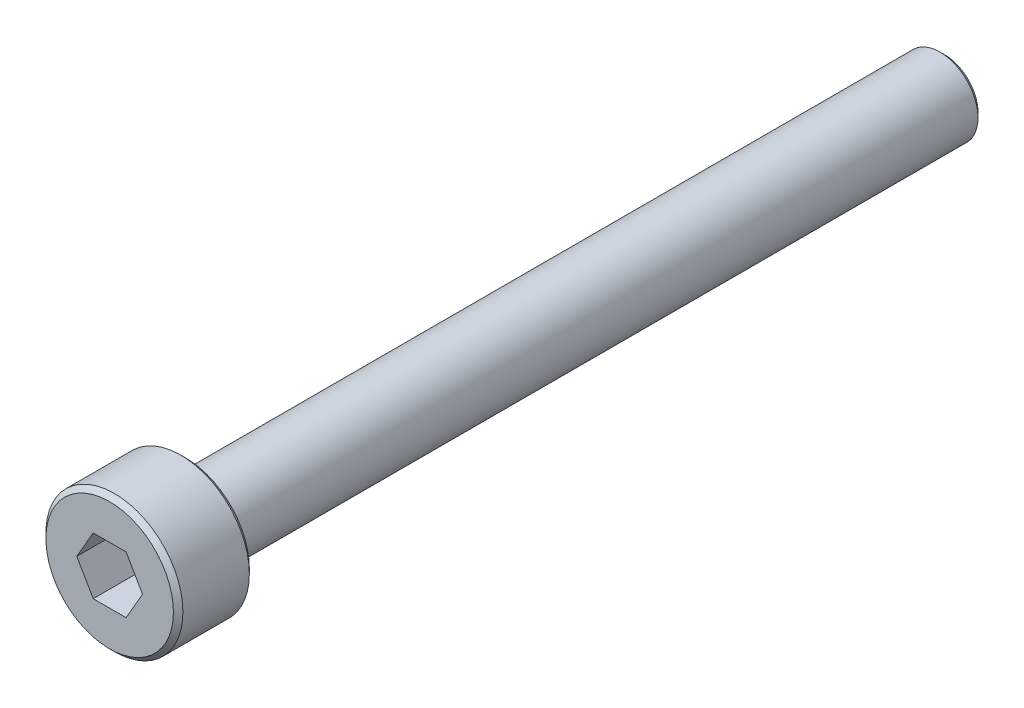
ISO-10303-21;
HEADER;
FILE_DESCRIPTION(('STEP AP214'),'2;1');
FILE_NAME('part.step','',(''),(''),'','','');
FILE_SCHEMA(('AUTOMOTIVE_DESIGN { 1 0 10303 214 1 1 1 1 }'));
ENDSEC;
DATA;
#1=APPLICATION_CONTEXT('core data for automotive mechanical design processes');
#2=APPLICATION_PROTOCOL_DEFINITION('international standard','automotive_design',2000,#1);
#3=PRODUCT_CONTEXT('',#1,'mechanical');
#4=PRODUCT('Part','Part','',(#3));
#5=PRODUCT_RELATED_PRODUCT_CATEGORY('part','',(#4));
#6=PRODUCT_DEFINITION_FORMATION('','',#4);
#7=PRODUCT_DEFINITION_CONTEXT('part definition',#1,'design');
#8=PRODUCT_DEFINITION('design','',#6,#7);
#9=PRODUCT_DEFINITION_SHAPE('','',#8);
#10=(LENGTH_UNIT() NAMED_UNIT(*) SI_UNIT(.MILLI.,.METRE.));
#11=(NAMED_UNIT(*) PLANE_ANGLE_UNIT() SI_UNIT($,.RADIAN.));
#12=(NAMED_UNIT(*) SI_UNIT($,.STERADIAN.) SOLID_ANGLE_UNIT());
#13=UNCERTAINTY_MEASURE_WITH_UNIT(LENGTH_MEASURE(1.E-05),#10,'distance_accuracy_value','');
#14=(GEOMETRIC_REPRESENTATION_CONTEXT(3) GLOBAL_UNCERTAINTY_ASSIGNED_CONTEXT((#13)) GLOBAL_UNIT_ASSIGNED_CONTEXT((#10,
#11,#12)) REPRESENTATION_CONTEXT('',''));
#15=CARTESIAN_POINT('',(0.,0.,0.));
#16=DIRECTION('',(0.,0.,1.));
#17=DIRECTION('',(1.,0.,0.));
#18=AXIS2_PLACEMENT_3D('',#15,#16,#17);
#19=CARTESIAN_POINT('',(0.,0.,40.));
#20=DIRECTION('',(0.,0.,-1.));
#21=DIRECTION('',(-1.,0.,0.));
#22=AXIS2_PLACEMENT_3D('',#19,#20,#21);
#23=CYLINDRICAL_SURFACE('',#22,2.);
#24=CARTESIAN_POINT('',(0.,0.,0.25));
#25=DIRECTION('',(0.,0.,1.));
#26=DIRECTION('',(1.,0.,0.));
#27=AXIS2_PLACEMENT_3D('',#24,#25,#26);
#28=CIRCLE('',#27,2.);
#29=CARTESIAN_POINT('',(2.,0.,0.25));
#30=VERTEX_POINT('',#29);
#31=EDGE_CURVE('E177',#30,#30,#28,.T.);
#32=ORIENTED_EDGE('',*,*,#31,.T.);
#33=EDGE_LOOP('',(#32));
#34=FACE_BOUND('',#33,.T.);
#35=CARTESIAN_POINT('',(0.,0.,40.));
#36=DIRECTION('',(0.,0.,1.));
#37=DIRECTION('',(1.,0.,0.));
#38=AXIS2_PLACEMENT_3D('',#35,#36,#37);
#39=CIRCLE('',#38,2.);
#40=CARTESIAN_POINT('',(2.,0.,40.));
#41=VERTEX_POINT('',#40);
#42=EDGE_CURVE('E162',#41,#41,#39,.T.);
#43=ORIENTED_EDGE('',*,*,#42,.F.);
#44=EDGE_LOOP('',(#43));
#45=FACE_BOUND('',#44,.T.);
#46=ADVANCED_FACE('F50',(#34,#45),#23,.T.);
#47=CARTESIAN_POINT('',(0.,0.,0.));
#48=DIRECTION('',(0.,0.,1.));
#49=DIRECTION('',(1.,0.,0.));
#50=AXIS2_PLACEMENT_3D('',#47,#48,#49);
#51=PLANE('',#50);
#52=CARTESIAN_POINT('',(0.,0.,0.));
#53=DIRECTION('',(0.,0.,1.));
#54=DIRECTION('',(1.,0.,0.));
#55=AXIS2_PLACEMENT_3D('',#52,#53,#54);
#56=CIRCLE('',#55,1.75);
#57=CARTESIAN_POINT('',(1.75,0.,0.));
#58=VERTEX_POINT('',#57);
#59=EDGE_CURVE('E178',#58,#58,#56,.F.);
#60=ORIENTED_EDGE('',*,*,#59,.T.);
#61=EDGE_LOOP('',(#60));
#62=FACE_BOUND('',#61,.T.);
#63=ADVANCED_FACE('F208',(#62),#51,.F.);
#64=CARTESIAN_POINT('',(0.,0.,44.));
#65=DIRECTION('',(0.,0.,-1.));
#66=DIRECTION('',(-1.,0.,0.));
#67=AXIS2_PLACEMENT_3D('',#64,#65,#66);
#68=CYLINDRICAL_SURFACE('',#67,3.61);
#69=CARTESIAN_POINT('',(0.,0.,40.25));
#70=DIRECTION('',(0.,0.,1.));
#71=DIRECTION('',(1.,0.,0.));
#72=AXIS2_PLACEMENT_3D('',#69,#70,#71);
#73=CIRCLE('',#72,3.61);
#74=CARTESIAN_POINT('',(3.61,0.,40.25));
#75=VERTEX_POINT('',#74);
#76=EDGE_CURVE('E187',#75,#75,#73,.T.);
#77=ORIENTED_EDGE('',*,*,#76,.T.);
#78=EDGE_LOOP('',(#77));
#79=FACE_BOUND('',#78,.T.);
#80=CARTESIAN_POINT('',(0.,0.,43.75));
#81=DIRECTION('',(0.,0.,1.));
#82=DIRECTION('',(1.,0.,0.));
#83=AXIS2_PLACEMENT_3D('',#80,#81,#82);
#84=CIRCLE('',#83,3.61);
#85=CARTESIAN_POINT('',(3.61,0.,43.75));
#86=VERTEX_POINT('',#85);
#87=EDGE_CURVE('E184',#86,#86,#84,.F.);
#88=ORIENTED_EDGE('',*,*,#87,.T.);
#89=EDGE_LOOP('',(#88));
#90=FACE_BOUND('',#89,.T.);
#91=ADVANCED_FACE('F204',(#79,#90),#68,.T.);
#92=CARTESIAN_POINT('',(0.,0.,44.));
#93=DIRECTION('',(0.,0.,1.));
#94=DIRECTION('',(1.,0.,0.));
#95=AXIS2_PLACEMENT_3D('',#92,#93,#94);
#96=PLANE('',#95);
#97=CARTESIAN_POINT('',(0.,0.,44.));
#98=DIRECTION('',(0.,0.,1.));
#99=DIRECTION('',(1.,0.,0.));
#100=AXIS2_PLACEMENT_3D('',#97,#98,#99);
#101=CIRCLE('',#100,3.36000000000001);
#102=CARTESIAN_POINT('',(3.36000000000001,0.,44.));
#103=VERTEX_POINT('',#102);
#104=EDGE_CURVE('E11',#103,#103,#101,.T.);
#105=ORIENTED_EDGE('',*,*,#104,.T.);
#106=EDGE_LOOP('',(#105));
#107=FACE_BOUND('',#106,.T.);
#108=DIRECTION('',(0.5,0.866025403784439,0.));
#109=VECTOR('',#108,1.);
#110=CARTESIAN_POINT('',(0.866025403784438,-1.5,44.));
#111=LINE('',#110,#109);
#112=CARTESIAN_POINT('',(0.866025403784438,-1.5,44.));
#113=VERTEX_POINT('',#112);
#114=CARTESIAN_POINT('',(1.73205080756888,0.,44.));
#115=VERTEX_POINT('',#114);
#116=EDGE_CURVE('E63',#113,#115,#111,.T.);
#117=ORIENTED_EDGE('',*,*,#116,.F.);
#118=DIRECTION('',(1.,0.,0.));
#119=VECTOR('',#118,1.);
#120=CARTESIAN_POINT('',(-0.866025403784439,-1.5,44.));
#121=LINE('',#120,#119);
#122=CARTESIAN_POINT('',(-0.866025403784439,-1.5,44.));
#123=VERTEX_POINT('',#122);
#124=EDGE_CURVE('E160',#123,#113,#121,.T.);
#125=ORIENTED_EDGE('',*,*,#124,.F.);
#126=DIRECTION('',(0.5,-0.866025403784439,0.));
#127=VECTOR('',#126,1.);
#128=CARTESIAN_POINT('',(-1.73205080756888,0.,44.));
#129=LINE('',#128,#127);
#130=CARTESIAN_POINT('',(-1.73205080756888,0.,44.));
#131=VERTEX_POINT('',#130);
#132=EDGE_CURVE('E152',#131,#123,#129,.T.);
#133=ORIENTED_EDGE('',*,*,#132,.F.);
#134=DIRECTION('',(-0.5,-0.866025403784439,0.));
#135=VECTOR('',#134,1.);
#136=CARTESIAN_POINT('',(-0.866025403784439,1.5,44.));
#137=LINE('',#136,#135);
#138=CARTESIAN_POINT('',(-0.866025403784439,1.5,44.));
#139=VERTEX_POINT('',#138);
#140=EDGE_CURVE('E115',#139,#131,#137,.T.);
#141=ORIENTED_EDGE('',*,*,#140,.F.);
#142=DIRECTION('',(-1.,0.,0.));
#143=VECTOR('',#142,1.);
#144=CARTESIAN_POINT('',(0.866025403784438,1.5,44.));
#145=LINE('',#144,#143);
#146=CARTESIAN_POINT('',(0.866025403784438,1.5,44.));
#147=VERTEX_POINT('',#146);
#148=EDGE_CURVE('E146',#147,#139,#145,.T.);
#149=ORIENTED_EDGE('',*,*,#148,.F.);
#150=DIRECTION('',(-0.5,0.866025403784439,0.));
#151=VECTOR('',#150,1.);
#152=CARTESIAN_POINT('',(1.73205080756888,0.,44.));
#153=LINE('',#152,#151);
#154=EDGE_CURVE('E145',#115,#147,#153,.T.);
#155=ORIENTED_EDGE('',*,*,#154,.F.);
#156=EDGE_LOOP('',(#117,#125,#133,#141,#149,#155));
#157=FACE_BOUND('',#156,.T.);
#158=ADVANCED_FACE('F210',(#107,#157),#96,.T.);
#159=CARTESIAN_POINT('',(0.,0.,40.));
#160=DIRECTION('',(0.,0.,1.));
#161=DIRECTION('',(1.,0.,0.));
#162=AXIS2_PLACEMENT_3D('',#159,#160,#161);
#163=PLANE('',#162);
#164=CARTESIAN_POINT('',(0.,0.,40.));
#165=DIRECTION('',(0.,0.,1.));
#166=DIRECTION('',(1.,0.,0.));
#167=AXIS2_PLACEMENT_3D('',#164,#165,#166);
#168=CIRCLE('',#167,3.36000000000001);
#169=CARTESIAN_POINT('',(3.36000000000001,0.,40.));
#170=VERTEX_POINT('',#169);
#171=EDGE_CURVE('E60',#170,#170,#168,.F.);
#172=ORIENTED_EDGE('',*,*,#171,.T.);
#173=EDGE_LOOP('',(#172));
#174=FACE_BOUND('',#173,.T.);
#175=ORIENTED_EDGE('',*,*,#42,.T.);
#176=EDGE_LOOP('',(#175));
#177=FACE_BOUND('',#176,.T.);
#178=ADVANCED_FACE('F193',(#174,#177),#163,.F.);
#179=CARTESIAN_POINT('',(0.866025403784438,-1.5,41.5));
#180=DIRECTION('',(0.866025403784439,-0.5,0.));
#181=DIRECTION('',(0.5,0.866025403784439,0.));
#182=AXIS2_PLACEMENT_3D('',#179,#180,#181);
#183=PLANE('',#182);
#184=ORIENTED_EDGE('',*,*,#116,.T.);
#185=DIRECTION('',(0.,0.,1.));
#186=VECTOR('',#185,1.);
#187=CARTESIAN_POINT('',(1.73205080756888,0.,41.5));
#188=LINE('',#187,#186);
#189=CARTESIAN_POINT('',(1.73205080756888,0.,41.5));
#190=VERTEX_POINT('',#189);
#191=EDGE_CURVE('E94',#190,#115,#188,.T.);
#192=ORIENTED_EDGE('',*,*,#191,.F.);
#193=DIRECTION('',(0.5,0.866025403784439,0.));
#194=VECTOR('',#193,1.);
#195=CARTESIAN_POINT('',(0.866025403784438,-1.5,41.5));
#196=LINE('',#195,#194);
#197=CARTESIAN_POINT('',(0.866025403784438,-1.5,41.5));
#198=VERTEX_POINT('',#197);
#199=EDGE_CURVE('E159',#198,#190,#196,.T.);
#200=ORIENTED_EDGE('',*,*,#199,.F.);
#201=DIRECTION('',(0.,0.,1.));
#202=VECTOR('',#201,1.);
#203=CARTESIAN_POINT('',(0.866025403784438,-1.5,41.5));
#204=LINE('',#203,#202);
#205=EDGE_CURVE('E75',#198,#113,#204,.T.);
#206=ORIENTED_EDGE('',*,*,#205,.T.);
#207=EDGE_LOOP('',(#184,#192,#200,#206));
#208=FACE_BOUND('',#207,.T.);
#209=ADVANCED_FACE('F230',(#208),#183,.F.);
#210=CARTESIAN_POINT('',(-0.866025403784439,-1.5,41.5));
#211=DIRECTION('',(0.,-1.,0.));
#212=DIRECTION('',(1.,0.,0.));
#213=AXIS2_PLACEMENT_3D('',#210,#211,#212);
#214=PLANE('',#213);
#215=ORIENTED_EDGE('',*,*,#124,.T.);
#216=ORIENTED_EDGE('',*,*,#205,.F.);
#217=DIRECTION('',(1.,0.,0.));
#218=VECTOR('',#217,1.);
#219=CARTESIAN_POINT('',(-0.866025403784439,-1.5,41.5));
#220=LINE('',#219,#218);
#221=CARTESIAN_POINT('',(-0.866025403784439,-1.5,41.5));
#222=VERTEX_POINT('',#221);
#223=EDGE_CURVE('E127',#222,#198,#220,.T.);
#224=ORIENTED_EDGE('',*,*,#223,.F.);
#225=DIRECTION('',(0.,0.,1.));
#226=VECTOR('',#225,1.);
#227=CARTESIAN_POINT('',(-0.866025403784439,-1.5,41.5));
#228=LINE('',#227,#226);
#229=EDGE_CURVE('E120',#222,#123,#228,.T.);
#230=ORIENTED_EDGE('',*,*,#229,.T.);
#231=EDGE_LOOP('',(#215,#216,#224,#230));
#232=FACE_BOUND('',#231,.T.);
#233=ADVANCED_FACE('F228',(#232),#214,.F.);
#234=CARTESIAN_POINT('',(-1.73205080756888,0.,41.5));
#235=DIRECTION('',(-0.866025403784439,-0.5,0.));
#236=DIRECTION('',(0.5,-0.866025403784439,0.));
#237=AXIS2_PLACEMENT_3D('',#234,#235,#236);
#238=PLANE('',#237);
#239=ORIENTED_EDGE('',*,*,#132,.T.);
#240=ORIENTED_EDGE('',*,*,#229,.F.);
#241=DIRECTION('',(0.5,-0.866025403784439,0.));
#242=VECTOR('',#241,1.);
#243=CARTESIAN_POINT('',(-1.73205080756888,0.,41.5));
#244=LINE('',#243,#242);
#245=CARTESIAN_POINT('',(-1.73205080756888,0.,41.5));
#246=VERTEX_POINT('',#245);
#247=EDGE_CURVE('E122',#246,#222,#244,.T.);
#248=ORIENTED_EDGE('',*,*,#247,.F.);
#249=DIRECTION('',(0.,0.,1.));
#250=VECTOR('',#249,1.);
#251=CARTESIAN_POINT('',(-1.73205080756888,0.,41.5));
#252=LINE('',#251,#250);
#253=EDGE_CURVE('E104',#246,#131,#252,.T.);
#254=ORIENTED_EDGE('',*,*,#253,.T.);
#255=EDGE_LOOP('',(#239,#240,#248,#254));
#256=FACE_BOUND('',#255,.T.);
#257=ADVANCED_FACE('F125',(#256),#238,.F.);
#258=CARTESIAN_POINT('',(-0.866025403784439,1.5,41.5));
#259=DIRECTION('',(-0.866025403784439,0.5,0.));
#260=DIRECTION('',(-0.5,-0.866025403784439,0.));
#261=AXIS2_PLACEMENT_3D('',#258,#259,#260);
#262=PLANE('',#261);
#263=ORIENTED_EDGE('',*,*,#140,.T.);
#264=ORIENTED_EDGE('',*,*,#253,.F.);
#265=DIRECTION('',(-0.5,-0.866025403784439,0.));
#266=VECTOR('',#265,1.);
#267=CARTESIAN_POINT('',(-0.866025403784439,1.5,41.5));
#268=LINE('',#267,#266);
#269=CARTESIAN_POINT('',(-0.866025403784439,1.5,41.5));
#270=VERTEX_POINT('',#269);
#271=EDGE_CURVE('E108',#270,#246,#268,.T.);
#272=ORIENTED_EDGE('',*,*,#271,.F.);
#273=DIRECTION('',(0.,0.,1.));
#274=VECTOR('',#273,1.);
#275=CARTESIAN_POINT('',(-0.866025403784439,1.5,41.5));
#276=LINE('',#275,#274);
#277=EDGE_CURVE('E117',#270,#139,#276,.T.);
#278=ORIENTED_EDGE('',*,*,#277,.T.);
#279=EDGE_LOOP('',(#263,#264,#272,#278));
#280=FACE_BOUND('',#279,.T.);
#281=ADVANCED_FACE('F110',(#280),#262,.F.);
#282=CARTESIAN_POINT('',(0.866025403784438,1.5,41.5));
#283=DIRECTION('',(0.,1.,0.));
#284=DIRECTION('',(-1.,0.,0.));
#285=AXIS2_PLACEMENT_3D('',#282,#283,#284);
#286=PLANE('',#285);
#287=ORIENTED_EDGE('',*,*,#148,.T.);
#288=ORIENTED_EDGE('',*,*,#277,.F.);
#289=DIRECTION('',(-1.,0.,0.));
#290=VECTOR('',#289,1.);
#291=CARTESIAN_POINT('',(0.866025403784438,1.5,41.5));
#292=LINE('',#291,#290);
#293=CARTESIAN_POINT('',(0.866025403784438,1.5,41.5));
#294=VERTEX_POINT('',#293);
#295=EDGE_CURVE('E135',#294,#270,#292,.T.);
#296=ORIENTED_EDGE('',*,*,#295,.F.);
#297=DIRECTION('',(0.,0.,1.));
#298=VECTOR('',#297,1.);
#299=CARTESIAN_POINT('',(0.866025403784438,1.5,41.5));
#300=LINE('',#299,#298);
#301=EDGE_CURVE('E169',#294,#147,#300,.T.);
#302=ORIENTED_EDGE('',*,*,#301,.T.);
#303=EDGE_LOOP('',(#287,#288,#296,#302));
#304=FACE_BOUND('',#303,.T.);
#305=ADVANCED_FACE('F268',(#304),#286,.F.);
#306=CARTESIAN_POINT('',(1.73205080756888,0.,41.5));
#307=DIRECTION('',(0.866025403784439,0.5,0.));
#308=DIRECTION('',(-0.5,0.866025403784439,0.));
#309=AXIS2_PLACEMENT_3D('',#306,#307,#308);
#310=PLANE('',#309);
#311=ORIENTED_EDGE('',*,*,#154,.T.);
#312=ORIENTED_EDGE('',*,*,#301,.F.);
#313=DIRECTION('',(-0.5,0.866025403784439,0.));
#314=VECTOR('',#313,1.);
#315=CARTESIAN_POINT('',(1.73205080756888,0.,41.5));
#316=LINE('',#315,#314);
#317=EDGE_CURVE('E137',#190,#294,#316,.T.);
#318=ORIENTED_EDGE('',*,*,#317,.F.);
#319=ORIENTED_EDGE('',*,*,#191,.T.);
#320=EDGE_LOOP('',(#311,#312,#318,#319));
#321=FACE_BOUND('',#320,.T.);
#322=ADVANCED_FACE('F224',(#321),#310,.F.);
#323=CARTESIAN_POINT('',(0.,0.,41.5));
#324=DIRECTION('',(0.,0.,1.));
#325=DIRECTION('',(1.,0.,0.));
#326=AXIS2_PLACEMENT_3D('',#323,#324,#325);
#327=PLANE('',#326);
#328=ORIENTED_EDGE('',*,*,#199,.T.);
#329=ORIENTED_EDGE('',*,*,#317,.T.);
#330=ORIENTED_EDGE('',*,*,#295,.T.);
#331=ORIENTED_EDGE('',*,*,#271,.T.);
#332=ORIENTED_EDGE('',*,*,#247,.T.);
#333=ORIENTED_EDGE('',*,*,#223,.T.);
#334=EDGE_LOOP('',(#328,#329,#330,#331,#332,#333));
#335=FACE_BOUND('',#334,.T.);
#336=ADVANCED_FACE('F129',(#335),#327,.T.);
#337=CARTESIAN_POINT('',(0.,0.,0.25));
#338=DIRECTION('',(0.,0.,1.));
#339=DIRECTION('',(1.,0.,0.));
#340=AXIS2_PLACEMENT_3D('',#337,#338,#339);
#341=CONICAL_SURFACE('',#340,2.,0.785398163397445);
#342=ORIENTED_EDGE('',*,*,#59,.F.);
#343=EDGE_LOOP('',(#342));
#344=FACE_BOUND('',#343,.T.);
#345=ORIENTED_EDGE('',*,*,#31,.F.);
#346=EDGE_LOOP('',(#345));
#347=FACE_BOUND('',#346,.T.);
#348=ADVANCED_FACE('F203',(#344,#347),#341,.T.);
#349=CARTESIAN_POINT('',(0.,0.,40.25));
#350=DIRECTION('',(0.,0.,1.));
#351=DIRECTION('',(1.,0.,0.));
#352=AXIS2_PLACEMENT_3D('',#349,#350,#351);
#353=CONICAL_SURFACE('',#352,3.61,0.785398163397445);
#354=ORIENTED_EDGE('',*,*,#171,.F.);
#355=EDGE_LOOP('',(#354));
#356=FACE_BOUND('',#355,.T.);
#357=ORIENTED_EDGE('',*,*,#76,.F.);
#358=EDGE_LOOP('',(#357));
#359=FACE_BOUND('',#358,.T.);
#360=ADVANCED_FACE('F196',(#356,#359),#353,.T.);
#361=CARTESIAN_POINT('',(0.,0.,44.));
#362=DIRECTION('',(0.,0.,-1.));
#363=DIRECTION('',(-1.,0.,0.));
#364=AXIS2_PLACEMENT_3D('',#361,#362,#363);
#365=CONICAL_SURFACE('',#364,3.36000000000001,0.785398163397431);
#366=ORIENTED_EDGE('',*,*,#87,.F.);
#367=EDGE_LOOP('',(#366));
#368=FACE_BOUND('',#367,.T.);
#369=ORIENTED_EDGE('',*,*,#104,.F.);
#370=EDGE_LOOP('',(#369));
#371=FACE_BOUND('',#370,.T.);
#372=ADVANCED_FACE('F49',(#368,#371),#365,.T.);
#373=CLOSED_SHELL('',(#46,#63,#91,#158,#178,#209,#233,#257,#281,#305,#322,#336,#348,#360,#372));
#374=MANIFOLD_SOLID_BREP('B2',#373);
#375=ADVANCED_BREP_SHAPE_REPRESENTATION('',(#18,#374),#14);
#376=SHAPE_DEFINITION_REPRESENTATION(#9,#375);
ENDSEC;
END-ISO-10303-21;
